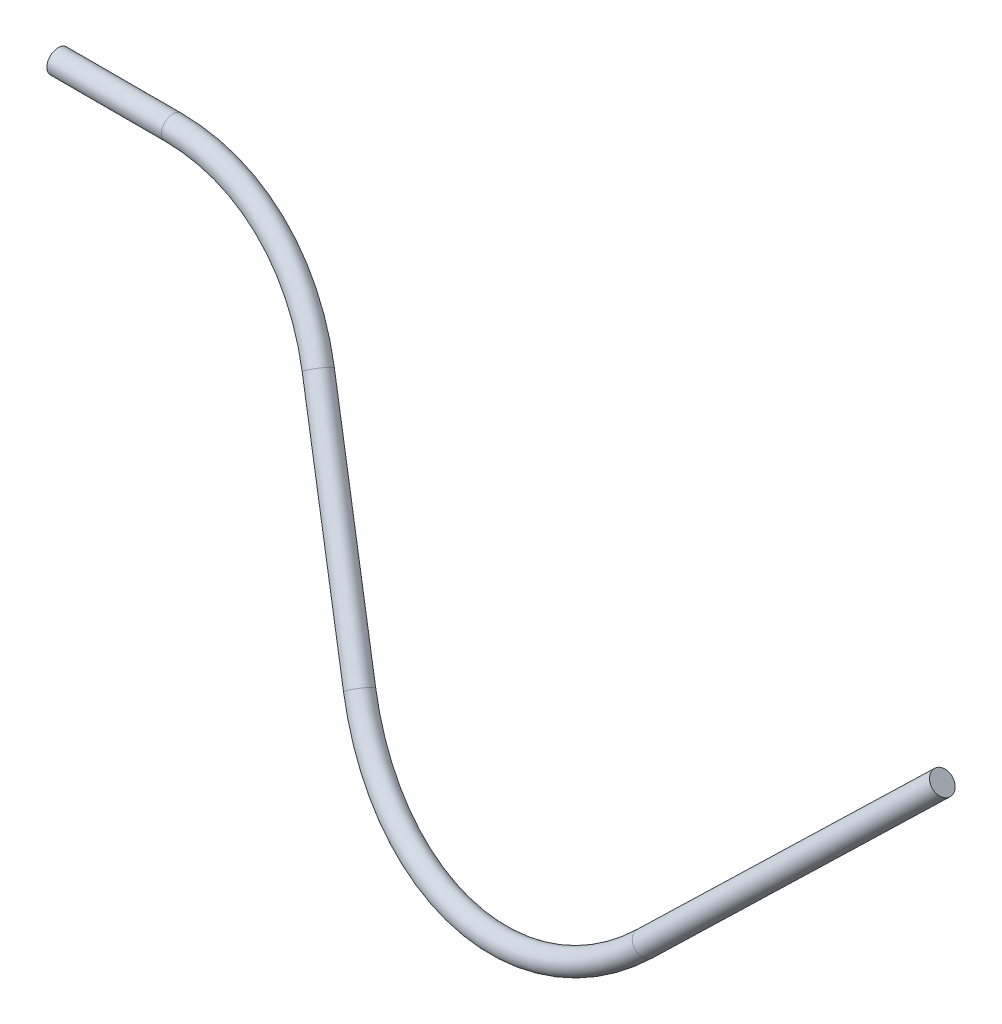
from build123d import *

# Parameters (mm, degrees)
SKIZZE1_R = 5


with BuildPart() as part:
    # Austragung1: sweep along a curve in space
    with BuildLine() as austragung1_path:
        Line((0, 0, 0), (50, 0, 0))
        ThreePointArc((50, 0, 0), (97.28708045, -10.631897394, 5.315948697), (133.33229812, -40, 20))
        Line((133.33229812, -40, 20), (188.61093857, -114.534673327, 57.267336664))
        ThreePointArc((188.61093857, -114.534673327, 57.267336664), (260.271930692, -151.464278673, 82.667223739), (339.3667278, -121.675924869, 83.623703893))
        Line((339.3667278, -121.675924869, 83.623703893), (446.197457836, -18.86224718, 60.896125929))
    # Skizze1 → Austragung1 (sweep)
    with BuildSketch(Plane(origin=(0, 0, 0), x_dir=(0, 0, -1), z_dir=(1, 0, 0))):
        Circle(SKIZZE1_R)
    sweep(path=austragung1_path.line)


solid = part.part
